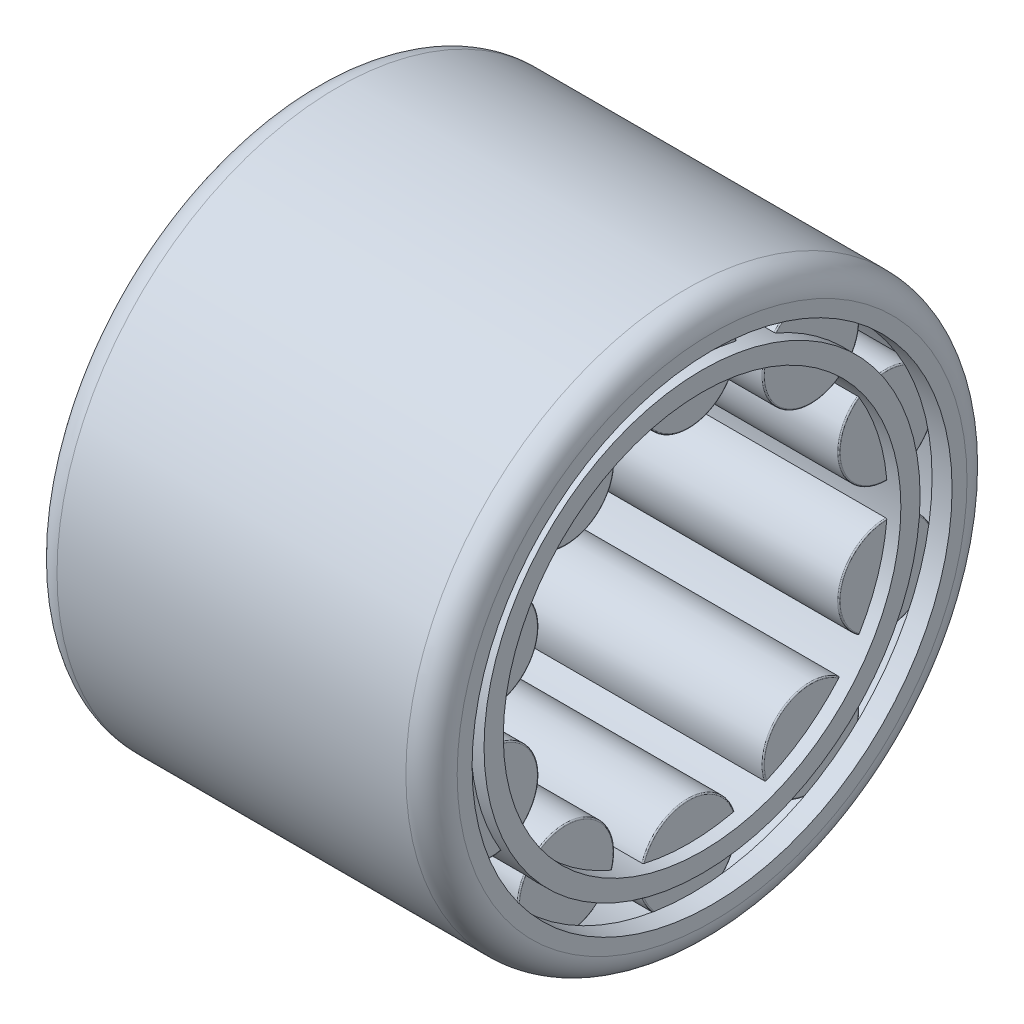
from build123d import *

# Parameters (mm, degrees)
CIRPATTERN1_COUNT = 10
SKETCH3_W         = 7.52855348
SKETCH3_H         = 0.38099967


with BuildPart() as part:
    # Sketch1 → Base-Revolve (revolve)
    with BuildSketch(Plane.XY, mode=Mode.PRIVATE) as base_revolve_sk:
        with BuildLine():
            Line((-3.566156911, 4.752970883), (-3.962396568, 4.752970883))
            Line((-3.962396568, 4.752970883), (-3.962396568, 5.048245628))
            ThreePointArc((-3.962396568, 5.048245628), (-3.813606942, 5.407455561), (-3.454397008, 5.556245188))
            Line((-3.454397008, 5.556245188), (3.454397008, 5.556245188))
            ThreePointArc((3.454397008, 5.556245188), (3.813606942, 5.407455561), (3.962396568, 5.048245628))
            Line((3.962396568, 5.048245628), (3.962396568, 4.752970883))
            Line((3.962396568, 4.752970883), (3.566156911, 4.752970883))
            Line((3.566156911, 4.752970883), (3.566156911, 4.991095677))
            Line((3.566156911, 4.991095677), (-3.566156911, 4.991095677))
            Line((-3.566156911, 4.991095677), (-3.566156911, 4.752970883))
        make_face()
    revolve(base_revolve_sk.sketch.rotate(Axis((-3.17499725, 0, 0), (1, 0, 0)), 270), axis=Axis((-3.17499725, 0, 0), (1, 0, 0)))

    # Sketch2 → Boss-Revolve1 (revolve)
    with BuildSketch(Plane.XY):
        with BuildLine():
            Line((-3.500116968, 5.056183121), (-3.500116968, 4.127496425))
            Line((-3.500116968, 4.127496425), (3.500116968, 4.127496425))
            Line((3.500116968, 4.127496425), (3.500116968, 5.056183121))
            ThreePointArc((3.500116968, 5.056183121), (3.493142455, 5.073021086), (3.476304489, 5.0799956))
            Line((3.476304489, 5.0799956), (-3.476304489, 5.0799956))
            ThreePointArc((-3.476304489, 5.0799956), (-3.493142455, 5.073021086), (-3.500116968, 5.056183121))
        make_face()
    boss_revolve1 = revolve(axis=Axis((-7.132313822, 4.127496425, 0), (1, 0, 0)))

    # CirPattern1: Boss-Revolve1 ×10 about axis
    cirpattern1_axis = Axis((-50, 0, 0), (1, 0, 0))
    for i in range(1, CIRPATTERN1_COUNT):
        add(boss_revolve1.rotate(cirpattern1_axis, i * 360 / CIRPATTERN1_COUNT))

    # Sketch3 → Boss-Revolve2 (revolve)
    with BuildSketch(Plane.XY, mode=Mode.PRIVATE) as boss_revolve2_sk:
        with Locations((0, 4.127496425)):
            Rectangle(SKETCH3_W, SKETCH3_H)
    revolve(boss_revolve2_sk.sketch.rotate(Axis((-3.17499725, 0, 0), (1, 0, 0)), 270), axis=Axis((-3.17499725, 0, 0), (1, 0, 0)))


solid = part.part
